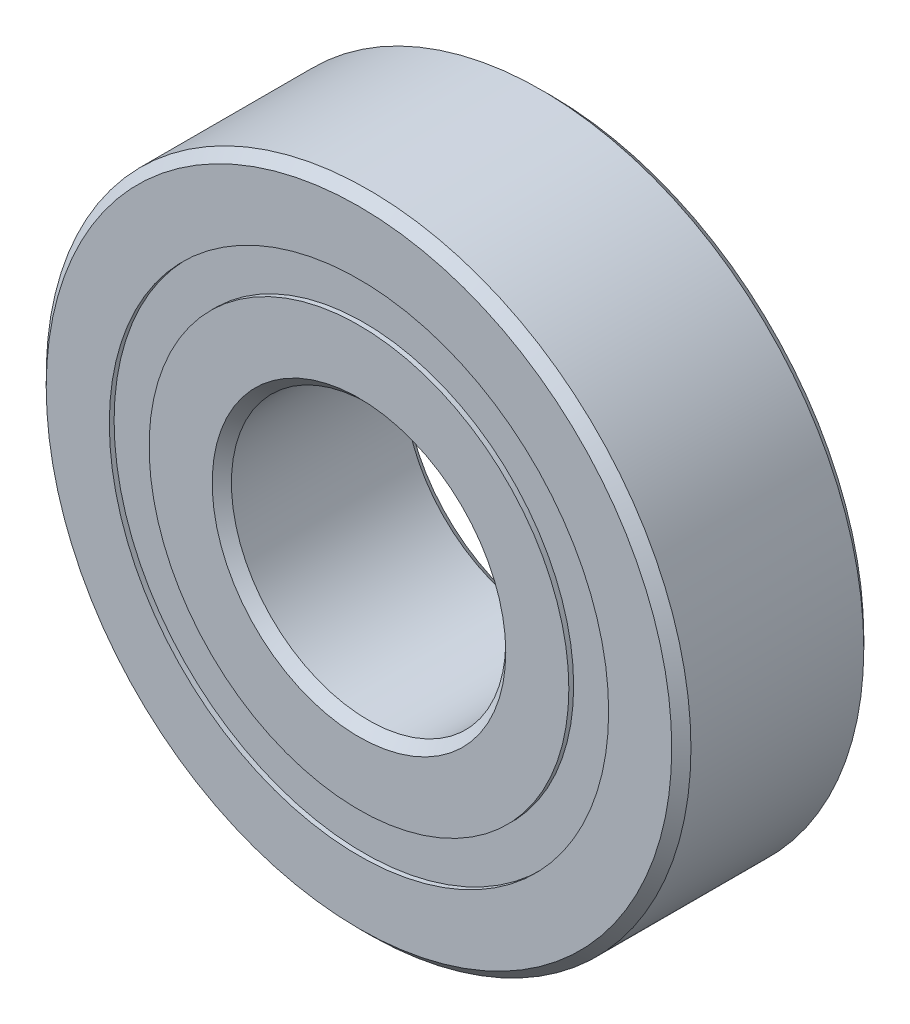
ISO-10303-21;
HEADER;
FILE_DESCRIPTION(('STEP AP214'),'2;1');
FILE_NAME('part.step','',(''),(''),'','','');
FILE_SCHEMA(('AUTOMOTIVE_DESIGN { 1 0 10303 214 1 1 1 1 }'));
ENDSEC;
DATA;
#1=APPLICATION_CONTEXT('core data for automotive mechanical design processes');
#2=APPLICATION_PROTOCOL_DEFINITION('international standard','automotive_design',2000,#1);
#3=PRODUCT_CONTEXT('',#1,'mechanical');
#4=PRODUCT('Part','Part','',(#3));
#5=PRODUCT_RELATED_PRODUCT_CATEGORY('part','',(#4));
#6=PRODUCT_DEFINITION_FORMATION('','',#4);
#7=PRODUCT_DEFINITION_CONTEXT('part definition',#1,'design');
#8=PRODUCT_DEFINITION('design','',#6,#7);
#9=PRODUCT_DEFINITION_SHAPE('','',#8);
#10=(LENGTH_UNIT() NAMED_UNIT(*) SI_UNIT(.MILLI.,.METRE.));
#11=(NAMED_UNIT(*) PLANE_ANGLE_UNIT() SI_UNIT($,.RADIAN.));
#12=(NAMED_UNIT(*) SI_UNIT($,.STERADIAN.) SOLID_ANGLE_UNIT());
#13=UNCERTAINTY_MEASURE_WITH_UNIT(LENGTH_MEASURE(1.E-05),#10,'distance_accuracy_value','');
#14=(GEOMETRIC_REPRESENTATION_CONTEXT(3) GLOBAL_UNCERTAINTY_ASSIGNED_CONTEXT((#13)) GLOBAL_UNIT_ASSIGNED_CONTEXT((#10,
#11,#12)) REPRESENTATION_CONTEXT('',''));
#15=CARTESIAN_POINT('',(0.,0.,0.));
#16=DIRECTION('',(0.,0.,1.));
#17=DIRECTION('',(1.,0.,0.));
#18=AXIS2_PLACEMENT_3D('',#15,#16,#17);
#19=CARTESIAN_POINT('',(0.,18.2005494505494,-6.65000000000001));
#20=DIRECTION('',(0.,0.,1.));
#21=DIRECTION('',(1.,0.,0.));
#22=AXIS2_PLACEMENT_3D('',#19,#20,#21);
#23=PLANE('',#22);
#24=CARTESIAN_POINT('',(0.,0.,-6.65000000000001));
#25=DIRECTION('',(0.,0.,1.));
#26=DIRECTION('',(1.,0.,0.));
#27=AXIS2_PLACEMENT_3D('',#24,#25,#26);
#28=CIRCLE('',#27,18.2005494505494);
#29=CARTESIAN_POINT('',(18.2005494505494,0.,-6.65000000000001));
#30=VERTEX_POINT('',#29);
#31=EDGE_CURVE('E55',#30,#30,#28,.T.);
#32=ORIENTED_EDGE('',*,*,#31,.F.);
#33=EDGE_LOOP('',(#32));
#34=FACE_BOUND('',#33,.T.);
#35=CARTESIAN_POINT('',(0.,0.,-6.65000000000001));
#36=DIRECTION('',(0.,0.,1.));
#37=DIRECTION('',(1.,0.,0.));
#38=AXIS2_PLACEMENT_3D('',#35,#36,#37);
#39=CIRCLE('',#38,15.2994505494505);
#40=CARTESIAN_POINT('',(15.2994505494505,0.,-6.65000000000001));
#41=VERTEX_POINT('',#40);
#42=EDGE_CURVE('E11',#41,#41,#39,.T.);
#43=ORIENTED_EDGE('',*,*,#42,.T.);
#44=EDGE_LOOP('',(#43));
#45=FACE_BOUND('',#44,.T.);
#46=ADVANCED_FACE('F41',(#34,#45),#23,.F.);
#47=CARTESIAN_POINT('',(0.,0.,7.));
#48=DIRECTION('',(0.,0.,1.));
#49=DIRECTION('',(1.,0.,0.));
#50=AXIS2_PLACEMENT_3D('',#47,#48,#49);
#51=CYLINDRICAL_SURFACE('',#50,15.2994505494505);
#52=ORIENTED_EDGE('',*,*,#42,.F.);
#53=EDGE_LOOP('',(#52));
#54=FACE_BOUND('',#53,.T.);
#55=CARTESIAN_POINT('',(0.,0.,-3.43265291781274));
#56=DIRECTION('',(0.,0.,1.));
#57=DIRECTION('',(1.,0.,0.));
#58=AXIS2_PLACEMENT_3D('',#55,#56,#57);
#59=CIRCLE('',#58,15.2994505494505);
#60=CARTESIAN_POINT('',(15.2994505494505,0.,-3.43265291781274));
#61=VERTEX_POINT('',#60);
#62=EDGE_CURVE('E47',#61,#61,#59,.T.);
#63=ORIENTED_EDGE('',*,*,#62,.T.);
#64=EDGE_LOOP('',(#63));
#65=FACE_BOUND('',#64,.T.);
#66=ADVANCED_FACE('F64',(#54,#65),#51,.F.);
#67=CARTESIAN_POINT('',(0.,18.2005494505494,-3.43265291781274));
#68=DIRECTION('',(0.,0.,-1.));
#69=DIRECTION('',(-1.,0.,0.));
#70=AXIS2_PLACEMENT_3D('',#67,#68,#69);
#71=PLANE('',#70);
#72=ORIENTED_EDGE('',*,*,#62,.F.);
#73=EDGE_LOOP('',(#72));
#74=FACE_BOUND('',#73,.T.);
#75=CARTESIAN_POINT('',(0.,0.,-3.43265291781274));
#76=DIRECTION('',(0.,0.,1.));
#77=DIRECTION('',(1.,0.,0.));
#78=AXIS2_PLACEMENT_3D('',#75,#76,#77);
#79=CIRCLE('',#78,18.2005494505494);
#80=CARTESIAN_POINT('',(18.2005494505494,0.,-3.43265291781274));
#81=VERTEX_POINT('',#80);
#82=EDGE_CURVE('E51',#81,#81,#79,.T.);
#83=ORIENTED_EDGE('',*,*,#82,.T.);
#84=EDGE_LOOP('',(#83));
#85=FACE_BOUND('',#84,.T.);
#86=ADVANCED_FACE('F68',(#74,#85),#71,.F.);
#87=CARTESIAN_POINT('',(0.,0.,7.));
#88=DIRECTION('',(0.,0.,1.));
#89=DIRECTION('',(1.,0.,0.));
#90=AXIS2_PLACEMENT_3D('',#87,#88,#89);
#91=CYLINDRICAL_SURFACE('',#90,18.2005494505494);
#92=ORIENTED_EDGE('',*,*,#82,.F.);
#93=EDGE_LOOP('',(#92));
#94=FACE_BOUND('',#93,.T.);
#95=ORIENTED_EDGE('',*,*,#31,.T.);
#96=EDGE_LOOP('',(#95));
#97=FACE_BOUND('',#96,.T.);
#98=ADVANCED_FACE('F61',(#94,#97),#91,.T.);
#99=CLOSED_SHELL('',(#46,#66,#86,#98));
#100=MANIFOLD_SOLID_BREP('B2',#99);
#101=CARTESIAN_POINT('',(0.,18.2005494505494,6.65));
#102=DIRECTION('',(0.,0.,-1.));
#103=DIRECTION('',(-1.,0.,0.));
#104=AXIS2_PLACEMENT_3D('',#101,#102,#103);
#105=PLANE('',#104);
#106=CARTESIAN_POINT('',(0.,0.,6.65));
#107=DIRECTION('',(0.,0.,1.));
#108=DIRECTION('',(1.,0.,0.));
#109=AXIS2_PLACEMENT_3D('',#106,#107,#108);
#110=CIRCLE('',#109,15.2994505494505);
#111=CARTESIAN_POINT('',(15.2994505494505,0.,6.65));
#112=VERTEX_POINT('',#111);
#113=EDGE_CURVE('E40',#112,#112,#110,.T.);
#114=ORIENTED_EDGE('',*,*,#113,.F.);
#115=EDGE_LOOP('',(#114));
#116=FACE_BOUND('',#115,.T.);
#117=CARTESIAN_POINT('',(0.,0.,6.65));
#118=DIRECTION('',(0.,0.,1.));
#119=DIRECTION('',(1.,0.,0.));
#120=AXIS2_PLACEMENT_3D('',#117,#118,#119);
#121=CIRCLE('',#120,18.2005494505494);
#122=CARTESIAN_POINT('',(18.2005494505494,0.,6.65));
#123=VERTEX_POINT('',#122);
#124=EDGE_CURVE('E122',#123,#123,#121,.T.);
#125=ORIENTED_EDGE('',*,*,#124,.T.);
#126=EDGE_LOOP('',(#125));
#127=FACE_BOUND('',#126,.T.);
#128=ADVANCED_FACE('F108',(#116,#127),#105,.F.);
#129=CARTESIAN_POINT('',(0.,0.,7.));
#130=DIRECTION('',(0.,0.,1.));
#131=DIRECTION('',(1.,0.,0.));
#132=AXIS2_PLACEMENT_3D('',#129,#130,#131);
#133=CYLINDRICAL_SURFACE('',#132,15.2994505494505);
#134=CARTESIAN_POINT('',(0.,0.,3.43265291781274));
#135=DIRECTION('',(0.,0.,1.));
#136=DIRECTION('',(1.,0.,0.));
#137=AXIS2_PLACEMENT_3D('',#134,#135,#136);
#138=CIRCLE('',#137,15.2994505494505);
#139=CARTESIAN_POINT('',(15.2994505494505,0.,3.43265291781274));
#140=VERTEX_POINT('',#139);
#141=EDGE_CURVE('E114',#140,#140,#138,.T.);
#142=ORIENTED_EDGE('',*,*,#141,.F.);
#143=EDGE_LOOP('',(#142));
#144=FACE_BOUND('',#143,.T.);
#145=ORIENTED_EDGE('',*,*,#113,.T.);
#146=EDGE_LOOP('',(#145));
#147=FACE_BOUND('',#146,.T.);
#148=ADVANCED_FACE('F137',(#144,#147),#133,.F.);
#149=CARTESIAN_POINT('',(0.,18.2005494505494,3.43265291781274));
#150=DIRECTION('',(0.,0.,1.));
#151=DIRECTION('',(1.,0.,0.));
#152=AXIS2_PLACEMENT_3D('',#149,#150,#151);
#153=PLANE('',#152);
#154=CARTESIAN_POINT('',(0.,0.,3.43265291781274));
#155=DIRECTION('',(0.,0.,1.));
#156=DIRECTION('',(1.,0.,0.));
#157=AXIS2_PLACEMENT_3D('',#154,#155,#156);
#158=CIRCLE('',#157,18.2005494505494);
#159=CARTESIAN_POINT('',(18.2005494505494,0.,3.43265291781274));
#160=VERTEX_POINT('',#159);
#161=EDGE_CURVE('E118',#160,#160,#158,.T.);
#162=ORIENTED_EDGE('',*,*,#161,.F.);
#163=EDGE_LOOP('',(#162));
#164=FACE_BOUND('',#163,.T.);
#165=ORIENTED_EDGE('',*,*,#141,.T.);
#166=EDGE_LOOP('',(#165));
#167=FACE_BOUND('',#166,.T.);
#168=ADVANCED_FACE('F132',(#164,#167),#153,.F.);
#169=CARTESIAN_POINT('',(0.,0.,7.));
#170=DIRECTION('',(0.,0.,1.));
#171=DIRECTION('',(1.,0.,0.));
#172=AXIS2_PLACEMENT_3D('',#169,#170,#171);
#173=CYLINDRICAL_SURFACE('',#172,18.2005494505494);
#174=ORIENTED_EDGE('',*,*,#124,.F.);
#175=EDGE_LOOP('',(#174));
#176=FACE_BOUND('',#175,.T.);
#177=ORIENTED_EDGE('',*,*,#161,.T.);
#178=EDGE_LOOP('',(#177));
#179=FACE_BOUND('',#178,.T.);
#180=ADVANCED_FACE('F129',(#176,#179),#173,.T.);
#181=CLOSED_SHELL('',(#128,#148,#168,#180));
#182=MANIFOLD_SOLID_BREP('B6',#181);
#183=CARTESIAN_POINT('',(-8.37499999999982,14.5059255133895,0.));
#184=DIRECTION('',(0.,0.,1.));
#185=DIRECTION('',(-0.499999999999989,0.866025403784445,0.));
#186=AXIS2_PLACEMENT_3D('',#183,#184,#185);
#187=SPHERICAL_SURFACE('',#186,3.43265291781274);
#188=CARTESIAN_POINT('',(-8.37499999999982,14.5059255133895,3.43265291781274));
#189=VERTEX_POINT('',#188);
#190=VERTEX_LOOP('',#189);
#191=FACE_BOUND('',#190,.T.);
#192=ADVANCED_FACE('F175',(#191),#187,.T.);
#193=CLOSED_SHELL('',(#192));
#194=MANIFOLD_SOLID_BREP('B35',#193);
#195=CARTESIAN_POINT('',(-14.5059255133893,8.37500000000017,0.));
#196=DIRECTION('',(0.,0.,1.));
#197=DIRECTION('',(-0.866025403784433,0.50000000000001,0.));
#198=AXIS2_PLACEMENT_3D('',#195,#196,#197);
#199=SPHERICAL_SURFACE('',#198,3.43265291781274);
#200=CARTESIAN_POINT('',(-14.5059255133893,8.37500000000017,3.43265291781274));
#201=VERTEX_POINT('',#200);
#202=VERTEX_LOOP('',#201);
#203=FACE_BOUND('',#202,.T.);
#204=ADVANCED_FACE('F195',(#203),#199,.T.);
#205=CLOSED_SHELL('',(#204));
#206=MANIFOLD_SOLID_BREP('B104',#205);
#207=CARTESIAN_POINT('',(-16.75,1.75447038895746E-13,0.));
#208=DIRECTION('',(0.,0.,1.));
#209=DIRECTION('',(-1.,0.,0.));
#210=AXIS2_PLACEMENT_3D('',#207,#208,#209);
#211=SPHERICAL_SURFACE('',#210,3.43265291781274);
#212=CARTESIAN_POINT('',(-16.75,1.75447038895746E-13,3.43265291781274));
#213=VERTEX_POINT('',#212);
#214=VERTEX_LOOP('',#213);
#215=FACE_BOUND('',#214,.T.);
#216=ADVANCED_FACE('F215',(#215),#211,.T.);
#217=CLOSED_SHELL('',(#216));
#218=MANIFOLD_SOLID_BREP('B171',#217);
#219=CARTESIAN_POINT('',(-14.5059255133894,-8.37499999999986,0.));
#220=DIRECTION('',(0.,0.,1.));
#221=DIRECTION('',(-0.866025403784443,-0.499999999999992,0.));
#222=AXIS2_PLACEMENT_3D('',#219,#220,#221);
#223=SPHERICAL_SURFACE('',#222,3.43265291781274);
#224=CARTESIAN_POINT('',(-14.5059255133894,-8.37499999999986,3.43265291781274));
#225=VERTEX_POINT('',#224);
#226=VERTEX_LOOP('',#225);
#227=FACE_BOUND('',#226,.T.);
#228=ADVANCED_FACE('F235',(#227),#223,.T.);
#229=CLOSED_SHELL('',(#228));
#230=MANIFOLD_SOLID_BREP('B191',#229);
#231=CARTESIAN_POINT('',(-8.37500000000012,-14.5059255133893,0.));
#232=DIRECTION('',(0.,0.,1.));
#233=DIRECTION('',(-0.500000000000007,-0.866025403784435,0.));
#234=AXIS2_PLACEMENT_3D('',#231,#232,#233);
#235=SPHERICAL_SURFACE('',#234,3.43265291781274);
#236=CARTESIAN_POINT('',(-8.37500000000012,-14.5059255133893,3.43265291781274));
#237=VERTEX_POINT('',#236);
#238=VERTEX_LOOP('',#237);
#239=FACE_BOUND('',#238,.T.);
#240=ADVANCED_FACE('F255',(#239),#235,.T.);
#241=CLOSED_SHELL('',(#240));
#242=MANIFOLD_SOLID_BREP('B211',#241);
#243=CARTESIAN_POINT('',(-1.16964692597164E-13,-16.75,0.));
#244=DIRECTION('',(0.,0.,1.));
#245=DIRECTION('',(0.,-1.,0.));
#246=AXIS2_PLACEMENT_3D('',#243,#244,#245);
#247=SPHERICAL_SURFACE('',#246,3.43265291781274);
#248=CARTESIAN_POINT('',(-1.16964692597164E-13,-16.75,3.43265291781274));
#249=VERTEX_POINT('',#248);
#250=VERTEX_LOOP('',#249);
#251=FACE_BOUND('',#250,.T.);
#252=ADVANCED_FACE('F275',(#251),#247,.T.);
#253=CLOSED_SHELL('',(#252));
#254=MANIFOLD_SOLID_BREP('B231',#253);
#255=CARTESIAN_POINT('',(8.37499999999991,-14.5059255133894,0.));
#256=DIRECTION('',(0.,0.,1.));
#257=DIRECTION('',(0.499999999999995,-0.866025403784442,0.));
#258=AXIS2_PLACEMENT_3D('',#255,#256,#257);
#259=SPHERICAL_SURFACE('',#258,3.43265291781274);
#260=CARTESIAN_POINT('',(8.37499999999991,-14.5059255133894,3.43265291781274));
#261=VERTEX_POINT('',#260);
#262=VERTEX_LOOP('',#261);
#263=FACE_BOUND('',#262,.T.);
#264=ADVANCED_FACE('F295',(#263),#259,.T.);
#265=CLOSED_SHELL('',(#264));
#266=MANIFOLD_SOLID_BREP('B251',#265);
#267=CARTESIAN_POINT('',(14.5059255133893,-8.37500000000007,0.));
#268=DIRECTION('',(0.,0.,1.));
#269=DIRECTION('',(0.866025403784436,-0.500000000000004,0.));
#270=AXIS2_PLACEMENT_3D('',#267,#268,#269);
#271=SPHERICAL_SURFACE('',#270,3.43265291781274);
#272=CARTESIAN_POINT('',(14.5059255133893,-8.37500000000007,3.43265291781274));
#273=VERTEX_POINT('',#272);
#274=VERTEX_LOOP('',#273);
#275=FACE_BOUND('',#274,.T.);
#276=ADVANCED_FACE('F315',(#275),#271,.T.);
#277=CLOSED_SHELL('',(#276));
#278=MANIFOLD_SOLID_BREP('B271',#277);
#279=CARTESIAN_POINT('',(16.75,0.,0.));
#280=DIRECTION('',(0.,0.,1.));
#281=DIRECTION('',(1.,0.,0.));
#282=AXIS2_PLACEMENT_3D('',#279,#280,#281);
#283=SPHERICAL_SURFACE('',#282,3.43265291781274);
#284=CARTESIAN_POINT('',(16.75,0.,3.43265291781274));
#285=VERTEX_POINT('',#284);
#286=VERTEX_LOOP('',#285);
#287=FACE_BOUND('',#286,.T.);
#288=ADVANCED_FACE('F335',(#287),#283,.T.);
#289=CLOSED_SHELL('',(#288));
#290=MANIFOLD_SOLID_BREP('B291',#289);
#291=CARTESIAN_POINT('',(14.5059255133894,8.37499999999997,0.));
#292=DIRECTION('',(0.,0.,1.));
#293=DIRECTION('',(0.86602540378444,0.499999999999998,0.));
#294=AXIS2_PLACEMENT_3D('',#291,#292,#293);
#295=SPHERICAL_SURFACE('',#294,3.43265291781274);
#296=CARTESIAN_POINT('',(14.5059255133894,8.37499999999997,3.43265291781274));
#297=VERTEX_POINT('',#296);
#298=VERTEX_LOOP('',#297);
#299=FACE_BOUND('',#298,.T.);
#300=ADVANCED_FACE('F355',(#299),#295,.T.);
#301=CLOSED_SHELL('',(#300));
#302=MANIFOLD_SOLID_BREP('B311',#301);
#303=CARTESIAN_POINT('',(8.37500000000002,14.5059255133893,0.));
#304=DIRECTION('',(0.,0.,1.));
#305=DIRECTION('',(0.500000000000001,0.866025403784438,0.));
#306=AXIS2_PLACEMENT_3D('',#303,#304,#305);
#307=SPHERICAL_SURFACE('',#306,3.43265291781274);
#308=CARTESIAN_POINT('',(8.37500000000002,14.5059255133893,3.43265291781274));
#309=VERTEX_POINT('',#308);
#310=VERTEX_LOOP('',#309);
#311=FACE_BOUND('',#310,.T.);
#312=ADVANCED_FACE('F375',(#311),#307,.T.);
#313=CLOSED_SHELL('',(#312));
#314=MANIFOLD_SOLID_BREP('B331',#313);
#315=CARTESIAN_POINT('',(0.,16.75,0.));
#316=DIRECTION('',(0.,0.,1.));
#317=DIRECTION('',(0.,1.,0.));
#318=AXIS2_PLACEMENT_3D('',#315,#316,#317);
#319=SPHERICAL_SURFACE('',#318,3.43265291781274);
#320=CARTESIAN_POINT('',(0.,16.75,3.43265291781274));
#321=VERTEX_POINT('',#320);
#322=VERTEX_LOOP('',#321);
#323=FACE_BOUND('',#322,.T.);
#324=ADVANCED_FACE('F397',(#323),#319,.T.);
#325=CLOSED_SHELL('',(#324));
#326=MANIFOLD_SOLID_BREP('B351',#325);
#327=CARTESIAN_POINT('',(0.,15.2994505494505,7.00000000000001));
#328=DIRECTION('',(0.,0.,-1.));
#329=DIRECTION('',(-1.,0.,0.));
#330=AXIS2_PLACEMENT_3D('',#327,#328,#329);
#331=PLANE('',#330);
#332=CARTESIAN_POINT('',(0.,0.,7.00000000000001));
#333=DIRECTION('',(0.,0.,1.));
#334=DIRECTION('',(1.,0.,0.));
#335=AXIS2_PLACEMENT_3D('',#332,#333,#334);
#336=CIRCLE('',#335,10.7);
#337=CARTESIAN_POINT('',(10.7,0.,7.00000000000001));
#338=VERTEX_POINT('',#337);
#339=EDGE_CURVE('E444',#338,#338,#336,.T.);
#340=ORIENTED_EDGE('',*,*,#339,.F.);
#341=EDGE_LOOP('',(#340));
#342=FACE_BOUND('',#341,.T.);
#343=CARTESIAN_POINT('',(0.,0.,7.00000000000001));
#344=DIRECTION('',(0.,0.,1.));
#345=DIRECTION('',(1.,0.,0.));
#346=AXIS2_PLACEMENT_3D('',#343,#344,#345);
#347=CIRCLE('',#346,15.2994505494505);
#348=CARTESIAN_POINT('',(15.2994505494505,0.,7.00000000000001));
#349=VERTEX_POINT('',#348);
#350=EDGE_CURVE('E396',#349,#349,#347,.T.);
#351=ORIENTED_EDGE('',*,*,#350,.T.);
#352=EDGE_LOOP('',(#351));
#353=FACE_BOUND('',#352,.T.);
#354=ADVANCED_FACE('F416',(#342,#353),#331,.F.);
#355=CARTESIAN_POINT('',(0.,0.,7.));
#356=DIRECTION('',(0.,0.,1.));
#357=DIRECTION('',(1.,0.,0.));
#358=AXIS2_PLACEMENT_3D('',#355,#356,#357);
#359=CYLINDRICAL_SURFACE('',#358,15.2994505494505);
#360=ORIENTED_EDGE('',*,*,#350,.F.);
#361=EDGE_LOOP('',(#360));
#362=FACE_BOUND('',#361,.T.);
#363=CARTESIAN_POINT('',(0.,0.,3.11111111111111));
#364=DIRECTION('',(0.,0.,1.));
#365=DIRECTION('',(1.,0.,0.));
#366=AXIS2_PLACEMENT_3D('',#363,#364,#365);
#367=CIRCLE('',#366,15.2994505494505);
#368=CARTESIAN_POINT('',(15.2994505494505,0.,3.11111111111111));
#369=VERTEX_POINT('',#368);
#370=EDGE_CURVE('E422',#369,#369,#367,.T.);
#371=ORIENTED_EDGE('',*,*,#370,.T.);
#372=EDGE_LOOP('',(#371));
#373=FACE_BOUND('',#372,.T.);
#374=ADVANCED_FACE('F451',(#362,#373),#359,.T.);
#375=CARTESIAN_POINT('',(0.,0.,0.));
#376=DIRECTION('',(0.,0.,1.));
#377=DIRECTION('',(1.,0.,0.));
#378=AXIS2_PLACEMENT_3D('',#375,#376,#377);
#379=TOROIDAL_SURFACE('',#378,16.75,3.43265291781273);
#380=ORIENTED_EDGE('',*,*,#370,.F.);
#381=EDGE_LOOP('',(#380));
#382=FACE_BOUND('',#381,.T.);
#383=CARTESIAN_POINT('',(0.,0.,-3.11111111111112));
#384=DIRECTION('',(0.,0.,1.));
#385=DIRECTION('',(1.,0.,0.));
#386=AXIS2_PLACEMENT_3D('',#383,#384,#385);
#387=CIRCLE('',#386,15.2994505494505);
#388=CARTESIAN_POINT('',(15.2994505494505,0.,-3.11111111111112));
#389=VERTEX_POINT('',#388);
#390=EDGE_CURVE('E426',#389,#389,#387,.T.);
#391=ORIENTED_EDGE('',*,*,#390,.T.);
#392=EDGE_LOOP('',(#391));
#393=FACE_BOUND('',#392,.T.);
#394=ADVANCED_FACE('F455',(#382,#393),#379,.F.);
#395=CARTESIAN_POINT('',(0.,0.,7.));
#396=DIRECTION('',(0.,0.,1.));
#397=DIRECTION('',(1.,0.,0.));
#398=AXIS2_PLACEMENT_3D('',#395,#396,#397);
#399=CYLINDRICAL_SURFACE('',#398,15.2994505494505);
#400=ORIENTED_EDGE('',*,*,#390,.F.);
#401=EDGE_LOOP('',(#400));
#402=FACE_BOUND('',#401,.T.);
#403=CARTESIAN_POINT('',(0.,0.,-7.00000000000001));
#404=DIRECTION('',(0.,0.,1.));
#405=DIRECTION('',(1.,0.,0.));
#406=AXIS2_PLACEMENT_3D('',#403,#404,#405);
#407=CIRCLE('',#406,15.2994505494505);
#408=CARTESIAN_POINT('',(15.2994505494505,0.,-7.00000000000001));
#409=VERTEX_POINT('',#408);
#410=EDGE_CURVE('E430',#409,#409,#407,.T.);
#411=ORIENTED_EDGE('',*,*,#410,.T.);
#412=EDGE_LOOP('',(#411));
#413=FACE_BOUND('',#412,.T.);
#414=ADVANCED_FACE('F460',(#402,#413),#399,.T.);
#415=CARTESIAN_POINT('',(0.,10.7,-7.00000000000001));
#416=DIRECTION('',(0.,0.,1.));
#417=DIRECTION('',(1.,0.,0.));
#418=AXIS2_PLACEMENT_3D('',#415,#416,#417);
#419=PLANE('',#418);
#420=ORIENTED_EDGE('',*,*,#410,.F.);
#421=EDGE_LOOP('',(#420));
#422=FACE_BOUND('',#421,.T.);
#423=CARTESIAN_POINT('',(0.,0.,-7.00000000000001));
#424=DIRECTION('',(0.,0.,1.));
#425=DIRECTION('',(1.,0.,0.));
#426=AXIS2_PLACEMENT_3D('',#423,#424,#425);
#427=CIRCLE('',#426,10.7);
#428=CARTESIAN_POINT('',(10.7,0.,-7.00000000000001));
#429=VERTEX_POINT('',#428);
#430=EDGE_CURVE('E435',#429,#429,#427,.T.);
#431=ORIENTED_EDGE('',*,*,#430,.T.);
#432=EDGE_LOOP('',(#431));
#433=FACE_BOUND('',#432,.T.);
#434=ADVANCED_FACE('F466',(#422,#433),#419,.F.);
#435=CARTESIAN_POINT('',(0.,0.,-6.30000000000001));
#436=DIRECTION('',(0.,0.,-1.));
#437=DIRECTION('',(-1.,0.,0.));
#438=AXIS2_PLACEMENT_3D('',#435,#436,#437);
#439=CONICAL_SURFACE('',#438,10.,0.785398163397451);
#440=ORIENTED_EDGE('',*,*,#430,.F.);
#441=EDGE_LOOP('',(#440));
#442=FACE_BOUND('',#441,.T.);
#443=CARTESIAN_POINT('',(0.,0.,-6.30000000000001));
#444=DIRECTION('',(0.,0.,1.));
#445=DIRECTION('',(1.,0.,0.));
#446=AXIS2_PLACEMENT_3D('',#443,#444,#445);
#447=CIRCLE('',#446,10.);
#448=CARTESIAN_POINT('',(10.,0.,-6.30000000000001));
#449=VERTEX_POINT('',#448);
#450=EDGE_CURVE('E438',#449,#449,#447,.T.);
#451=ORIENTED_EDGE('',*,*,#450,.T.);
#452=EDGE_LOOP('',(#451));
#453=FACE_BOUND('',#452,.T.);
#454=ADVANCED_FACE('F470',(#442,#453),#439,.F.);
#455=CARTESIAN_POINT('',(0.,0.,7.));
#456=DIRECTION('',(0.,0.,1.));
#457=DIRECTION('',(1.,0.,0.));
#458=AXIS2_PLACEMENT_3D('',#455,#456,#457);
#459=CYLINDRICAL_SURFACE('',#458,10.);
#460=ORIENTED_EDGE('',*,*,#450,.F.);
#461=EDGE_LOOP('',(#460));
#462=FACE_BOUND('',#461,.T.);
#463=CARTESIAN_POINT('',(0.,0.,6.30000000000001));
#464=DIRECTION('',(0.,0.,1.));
#465=DIRECTION('',(1.,0.,0.));
#466=AXIS2_PLACEMENT_3D('',#463,#464,#465);
#467=CIRCLE('',#466,10.);
#468=CARTESIAN_POINT('',(10.,0.,6.30000000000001));
#469=VERTEX_POINT('',#468);
#470=EDGE_CURVE('E441',#469,#469,#467,.T.);
#471=ORIENTED_EDGE('',*,*,#470,.T.);
#472=EDGE_LOOP('',(#471));
#473=FACE_BOUND('',#472,.T.);
#474=ADVANCED_FACE('F474',(#462,#473),#459,.F.);
#475=CARTESIAN_POINT('',(0.,0.,7.00000000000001));
#476=DIRECTION('',(0.,0.,1.));
#477=DIRECTION('',(1.,0.,0.));
#478=AXIS2_PLACEMENT_3D('',#475,#476,#477);
#479=CONICAL_SURFACE('',#478,10.7,0.78539816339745);
#480=ORIENTED_EDGE('',*,*,#470,.F.);
#481=EDGE_LOOP('',(#480));
#482=FACE_BOUND('',#481,.T.);
#483=ORIENTED_EDGE('',*,*,#339,.T.);
#484=EDGE_LOOP('',(#483));
#485=FACE_BOUND('',#484,.T.);
#486=ADVANCED_FACE('F448',(#482,#485),#479,.F.);
#487=CLOSED_SHELL('',(#354,#374,#394,#414,#434,#454,#474,#486));
#488=MANIFOLD_SOLID_BREP('B371',#487);
#489=CARTESIAN_POINT('',(0.,0.,6.3));
#490=DIRECTION('',(0.,0.,-1.));
#491=DIRECTION('',(-1.,0.,0.));
#492=AXIS2_PLACEMENT_3D('',#489,#490,#491);
#493=CONICAL_SURFACE('',#492,23.5,0.78539816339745);
#494=CARTESIAN_POINT('',(0.,0.,7.));
#495=DIRECTION('',(0.,0.,1.));
#496=DIRECTION('',(1.,0.,0.));
#497=AXIS2_PLACEMENT_3D('',#494,#495,#496);
#498=CIRCLE('',#497,22.8);
#499=CARTESIAN_POINT('',(22.8,0.,7.));
#500=VERTEX_POINT('',#499);
#501=EDGE_CURVE('E565',#500,#500,#498,.T.);
#502=ORIENTED_EDGE('',*,*,#501,.F.);
#503=EDGE_LOOP('',(#502));
#504=FACE_BOUND('',#503,.T.);
#505=CARTESIAN_POINT('',(0.,0.,6.3));
#506=DIRECTION('',(0.,0.,1.));
#507=DIRECTION('',(1.,0.,0.));
#508=AXIS2_PLACEMENT_3D('',#505,#506,#507);
#509=CIRCLE('',#508,23.5);
#510=CARTESIAN_POINT('',(23.5,0.,6.3));
#511=VERTEX_POINT('',#510);
#512=EDGE_CURVE('E415',#511,#511,#509,.T.);
#513=ORIENTED_EDGE('',*,*,#512,.T.);
#514=EDGE_LOOP('',(#513));
#515=FACE_BOUND('',#514,.T.);
#516=ADVANCED_FACE('F537',(#504,#515),#493,.T.);
#517=CARTESIAN_POINT('',(0.,0.,7.));
#518=DIRECTION('',(0.,0.,1.));
#519=DIRECTION('',(1.,0.,0.));
#520=AXIS2_PLACEMENT_3D('',#517,#518,#519);
#521=CYLINDRICAL_SURFACE('',#520,23.5);
#522=ORIENTED_EDGE('',*,*,#512,.F.);
#523=EDGE_LOOP('',(#522));
#524=FACE_BOUND('',#523,.T.);
#525=CARTESIAN_POINT('',(0.,0.,-6.30000000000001));
#526=DIRECTION('',(0.,0.,1.));
#527=DIRECTION('',(1.,0.,0.));
#528=AXIS2_PLACEMENT_3D('',#525,#526,#527);
#529=CIRCLE('',#528,23.5);
#530=CARTESIAN_POINT('',(23.5,0.,-6.30000000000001));
#531=VERTEX_POINT('',#530);
#532=EDGE_CURVE('E543',#531,#531,#529,.T.);
#533=ORIENTED_EDGE('',*,*,#532,.T.);
#534=EDGE_LOOP('',(#533));
#535=FACE_BOUND('',#534,.T.);
#536=ADVANCED_FACE('F572',(#524,#535),#521,.T.);
#537=CARTESIAN_POINT('',(0.,0.,-7.00000000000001));
#538=DIRECTION('',(0.,0.,1.));
#539=DIRECTION('',(1.,0.,0.));
#540=AXIS2_PLACEMENT_3D('',#537,#538,#539);
#541=CONICAL_SURFACE('',#540,22.8,0.785398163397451);
#542=ORIENTED_EDGE('',*,*,#532,.F.);
#543=EDGE_LOOP('',(#542));
#544=FACE_BOUND('',#543,.T.);
#545=CARTESIAN_POINT('',(0.,0.,-7.00000000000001));
#546=DIRECTION('',(0.,0.,1.));
#547=DIRECTION('',(1.,0.,0.));
#548=AXIS2_PLACEMENT_3D('',#545,#546,#547);
#549=CIRCLE('',#548,22.8);
#550=CARTESIAN_POINT('',(22.8,0.,-7.00000000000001));
#551=VERTEX_POINT('',#550);
#552=EDGE_CURVE('E547',#551,#551,#549,.T.);
#553=ORIENTED_EDGE('',*,*,#552,.T.);
#554=EDGE_LOOP('',(#553));
#555=FACE_BOUND('',#554,.T.);
#556=ADVANCED_FACE('F576',(#544,#555),#541,.T.);
#557=CARTESIAN_POINT('',(0.,22.8,-7.00000000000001));
#558=DIRECTION('',(0.,0.,1.));
#559=DIRECTION('',(1.,0.,0.));
#560=AXIS2_PLACEMENT_3D('',#557,#558,#559);
#561=PLANE('',#560);
#562=ORIENTED_EDGE('',*,*,#552,.F.);
#563=EDGE_LOOP('',(#562));
#564=FACE_BOUND('',#563,.T.);
#565=CARTESIAN_POINT('',(0.,0.,-7.00000000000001));
#566=DIRECTION('',(0.,0.,1.));
#567=DIRECTION('',(1.,0.,0.));
#568=AXIS2_PLACEMENT_3D('',#565,#566,#567);
#569=CIRCLE('',#568,18.2005494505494);
#570=CARTESIAN_POINT('',(18.2005494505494,0.,-7.00000000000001));
#571=VERTEX_POINT('',#570);
#572=EDGE_CURVE('E551',#571,#571,#569,.T.);
#573=ORIENTED_EDGE('',*,*,#572,.T.);
#574=EDGE_LOOP('',(#573));
#575=FACE_BOUND('',#574,.T.);
#576=ADVANCED_FACE('F581',(#564,#575),#561,.F.);
#577=CARTESIAN_POINT('',(0.,0.,7.));
#578=DIRECTION('',(0.,0.,1.));
#579=DIRECTION('',(1.,0.,0.));
#580=AXIS2_PLACEMENT_3D('',#577,#578,#579);
#581=CYLINDRICAL_SURFACE('',#580,18.2005494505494);
#582=ORIENTED_EDGE('',*,*,#572,.F.);
#583=EDGE_LOOP('',(#582));
#584=FACE_BOUND('',#583,.T.);
#585=CARTESIAN_POINT('',(0.,0.,-3.11111111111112));
#586=DIRECTION('',(0.,0.,1.));
#587=DIRECTION('',(1.,0.,0.));
#588=AXIS2_PLACEMENT_3D('',#585,#586,#587);
#589=CIRCLE('',#588,18.2005494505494);
#590=CARTESIAN_POINT('',(18.2005494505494,0.,-3.11111111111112));
#591=VERTEX_POINT('',#590);
#592=EDGE_CURVE('E556',#591,#591,#589,.T.);
#593=ORIENTED_EDGE('',*,*,#592,.T.);
#594=EDGE_LOOP('',(#593));
#595=FACE_BOUND('',#594,.T.);
#596=ADVANCED_FACE('F587',(#584,#595),#581,.F.);
#597=CARTESIAN_POINT('',(0.,0.,0.));
#598=DIRECTION('',(0.,0.,1.));
#599=DIRECTION('',(1.,0.,0.));
#600=AXIS2_PLACEMENT_3D('',#597,#598,#599);
#601=TOROIDAL_SURFACE('',#600,16.75,3.43265291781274);
#602=ORIENTED_EDGE('',*,*,#592,.F.);
#603=EDGE_LOOP('',(#602));
#604=FACE_BOUND('',#603,.T.);
#605=CARTESIAN_POINT('',(0.,0.,3.11111111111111));
#606=DIRECTION('',(0.,0.,1.));
#607=DIRECTION('',(1.,0.,0.));
#608=AXIS2_PLACEMENT_3D('',#605,#606,#607);
#609=CIRCLE('',#608,18.2005494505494);
#610=CARTESIAN_POINT('',(18.2005494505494,0.,3.11111111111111));
#611=VERTEX_POINT('',#610);
#612=EDGE_CURVE('E559',#611,#611,#609,.T.);
#613=ORIENTED_EDGE('',*,*,#612,.T.);
#614=EDGE_LOOP('',(#613));
#615=FACE_BOUND('',#614,.T.);
#616=ADVANCED_FACE('F591',(#604,#615),#601,.F.);
#617=CARTESIAN_POINT('',(0.,0.,7.));
#618=DIRECTION('',(0.,0.,1.));
#619=DIRECTION('',(1.,0.,0.));
#620=AXIS2_PLACEMENT_3D('',#617,#618,#619);
#621=CYLINDRICAL_SURFACE('',#620,18.2005494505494);
#622=ORIENTED_EDGE('',*,*,#612,.F.);
#623=EDGE_LOOP('',(#622));
#624=FACE_BOUND('',#623,.T.);
#625=CARTESIAN_POINT('',(0.,0.,7.));
#626=DIRECTION('',(0.,0.,1.));
#627=DIRECTION('',(1.,0.,0.));
#628=AXIS2_PLACEMENT_3D('',#625,#626,#627);
#629=CIRCLE('',#628,18.2005494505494);
#630=CARTESIAN_POINT('',(18.2005494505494,0.,7.));
#631=VERTEX_POINT('',#630);
#632=EDGE_CURVE('E562',#631,#631,#629,.T.);
#633=ORIENTED_EDGE('',*,*,#632,.T.);
#634=EDGE_LOOP('',(#633));
#635=FACE_BOUND('',#634,.T.);
#636=ADVANCED_FACE('F595',(#624,#635),#621,.F.);
#637=CARTESIAN_POINT('',(0.,22.8,7.));
#638=DIRECTION('',(0.,0.,-1.));
#639=DIRECTION('',(-1.,0.,0.));
#640=AXIS2_PLACEMENT_3D('',#637,#638,#639);
#641=PLANE('',#640);
#642=ORIENTED_EDGE('',*,*,#632,.F.);
#643=EDGE_LOOP('',(#642));
#644=FACE_BOUND('',#643,.T.);
#645=ORIENTED_EDGE('',*,*,#501,.T.);
#646=EDGE_LOOP('',(#645));
#647=FACE_BOUND('',#646,.T.);
#648=ADVANCED_FACE('F569',(#644,#647),#641,.F.);
#649=CLOSED_SHELL('',(#516,#536,#556,#576,#596,#616,#636,#648));
#650=MANIFOLD_SOLID_BREP('B391',#649);
#651=ADVANCED_BREP_SHAPE_REPRESENTATION('',(#18,#100,#182,#194,#206,#218,#230,#242,#254,#266,
#278,#290,#302,#314,#326,#488,#650),#14);
#652=SHAPE_DEFINITION_REPRESENTATION(#9,#651);
ENDSEC;
END-ISO-10303-21;
